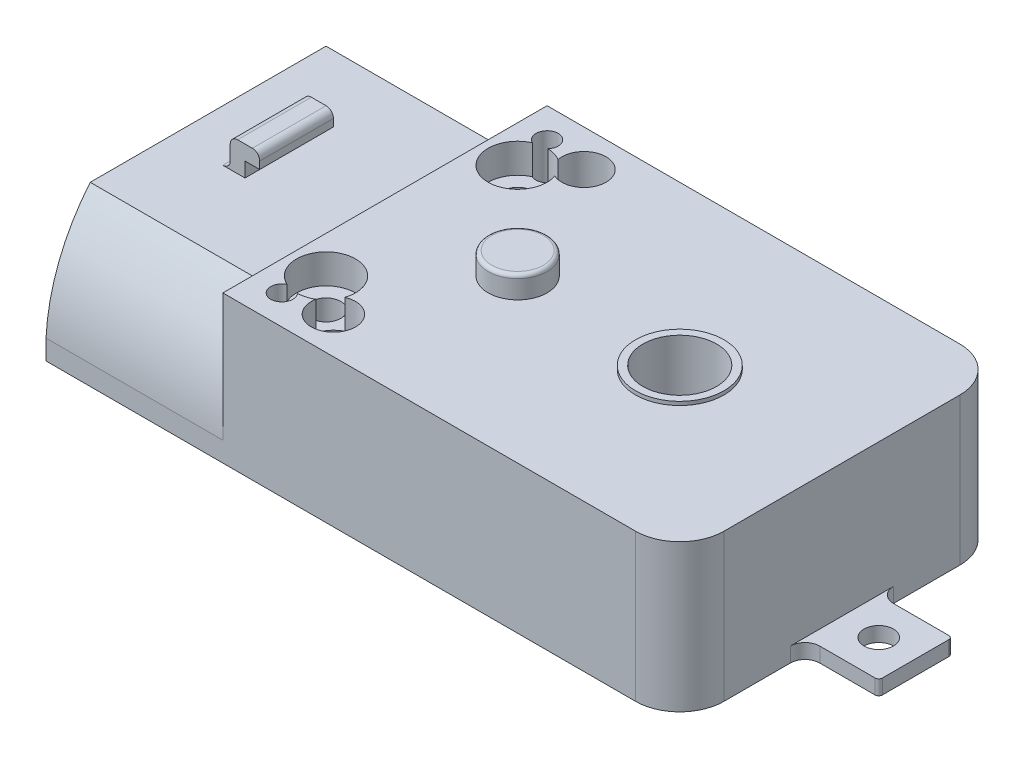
from build123d import *

# Parameters (mm, degrees)
BOSS_EXTRUDE2_DEPTH     = 9
SKETCH4_W               = 5
SKETCH4_H               = 1
BOSS_EXTRUDE3_DEPTH     = 5
SKETCH5_R               = 1
CUT_EXTRUDE1_DEPTH      = 5
FILLET1_R               = 1
FILLET2_R               = 1
FILLET3_R               = 3
FILLET4_R               = 3
BOSS_EXTRUDE4_DEPTH     = 12
FILLET6_R               = 0.25
CUT_EXTRUDE7_DEPTH      = 44.13930922
CUT_EXTRUDE7_DEPTH_BACK = 44.13930922
SKETCH10_R              = 1.5
SKETCH12_R              = 0.75
CUT_EXTRUDE8_DEPTH      = 3
SKETCH13_W              = 1
SKETCH13_H              = 5
BOSS_EXTRUDE5_DEPTH     = 2
SKETCH14_W              = 5
SKETCH14_H              = 1
BOSS_EXTRUDE6_DEPTH     = 1
FILLET7_R               = 0.5
FILLET8_R               = 0.5
FILLET9_R               = 0.5
CUT_EXTRUDE9_DEPTH      = 10
BOSS_EXTRUDE7_START     = 1
BOSS_EXTRUDE7_DEPTH     = 1
SKETCH18_R              = 1.5
CUT_EXTRUDE12_DEPTH     = 44.358966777
SKETCH19_R              = 0.75
CUT_EXTRUDE14_DEPTH     = 44.358966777
SKETCH20_R              = 2
BOSS_EXTRUDE8_DEPTH     = 1.5
FILLET10_R              = 0.25
SKETCH21_R              = 2.5
CUT_EXTRUDE15_DEPTH     = 5
BOSS_EXTRUDE9_START     = 0.25
SKETCH22_R              = 3
SKETCH22_R_2            = 2.5
BOSS_EXTRUDE9_DEPTH     = 0.25
SKETCH24_R              = 2
CUT_EXTRUDE16_DEPTH     = 2
SKETCH25_R              = 1
CUT_EXTRUDE17_DEPTH     = 5


with BuildPart() as part:
    # Sketch2 → Boss-Extrude2 (new body)
    with BuildSketch(Plane(origin=(0, 0, 0), x_dir=(1, 0, 0), z_dir=(0, 1, 0))):
        Polygon((0, 11), (31, 11), (31, 13.5), (31, 22), (0, 22), align=None)
        Polygon((31, 8.5), (31, 11), (0, 11), (0, 0), (31, 0), align=None)
    extrude(amount=BOSS_EXTRUDE2_DEPTH)

    # Sketch4 → Boss-Extrude3 (add)
    with BuildSketch(Plane(origin=(31, 0, 0), x_dir=(0, 0, -1), z_dir=(1, 0, 0))):
        with Locations((11, 0.5)):
            Rectangle(SKETCH4_W, SKETCH4_H)
    extrude(amount=BOSS_EXTRUDE3_DEPTH)

    # Sketch5 → Cut-Extrude1 (cut)
    with BuildSketch(Plane(origin=(0, 1, 0), x_dir=(1, 0, 0), z_dir=(0, 1, 0))):
        with Locations(Location((33.5, 11, 0), (0, 0, 270))):
            Circle(SKETCH5_R)
    extrude(amount=-CUT_EXTRUDE1_DEPTH, mode=Mode.SUBTRACT)

    # Fillet1
    fillet1_edges = [part.edges().sort_by_distance(p)[0] for p in [
        (31, 0.5, -8.5),
    ]]
    fillet(fillet1_edges, radius=FILLET1_R)

    # Fillet2
    fillet2_edges = [part.edges().sort_by_distance(p)[0] for p in [
        (31, 0.5, -13.5),
    ]]
    fillet(fillet2_edges, radius=FILLET2_R)

    # Fillet3
    fillet3_edges = [part.edges().sort_by_distance(p)[0] for p in [
        (31, 4.5, 0),
    ]]
    fillet(fillet3_edges, radius=FILLET3_R)

    # Fillet4
    fillet4_edges = [part.edges().sort_by_distance(p)[0] for p in [
        (31, 4.5, -22),
    ]]
    fillet(fillet4_edges, radius=FILLET4_R)

    # Sketch6 → Boss-Extrude4 (add)
    with BuildSketch(Plane.ZY):
        with BuildLine():
            Line((-22, 0), (-11, 0))
            Line((-11, 0), (-11, 9))
            Line((-11, 9), (-19, 9))
            ThreePointArc((-19, 9), (-21.121122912, 5.415884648), (-22, 1.344936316))
            Line((-22, 1.344936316), (-22, 0))
        make_face()
        with BuildLine():
            Line((-11, 9), (-11, 0))
            Line((-11, 0), (0, 0))
            Line((0, 0), (0, 1.344936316))
            ThreePointArc((0, 1.344936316), (-0.878877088, 5.415884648), (-3, 9))
            Line((-3, 9), (-11, 9))
        make_face()
    extrude(amount=BOSS_EXTRUDE4_DEPTH)

    # Fillet6
    fillet6_edges = [part.edges().sort_by_distance(p)[0] for p in [
        (36, 0.5, -13.5),
        (36, 0.5, -8.5),
    ]]
    fillet(fillet6_edges, radius=FILLET6_R)

    # Sketch10 → Cut-Extrude7 (cut, two sides: drawn at the far end of the back side and taken through both)
    with BuildSketch(Plane(origin=(0, 9, 0), x_dir=(1, 0, 0), z_dir=(0, 1, 0)).offset(-CUT_EXTRUDE7_DEPTH_BACK)):
        with Locations(Location((5, 19.5, 0), (0, 0, 270))):
            Circle(SKETCH10_R)
        with Locations(Location((5, 2.5, 0), (0, 0, 270))):
            Circle(SKETCH10_R)
    extrude(amount=CUT_EXTRUDE7_DEPTH + CUT_EXTRUDE7_DEPTH_BACK, mode=Mode.SUBTRACT)

    # Sketch12 → Cut-Extrude8 (cut)
    with BuildSketch(Plane(origin=(0, 9, 0), x_dir=(1, 0, 0), z_dir=(0, 1, 0))):
        with Locations(Location((2, 2, 0), (0, 0, 270))):
            Circle(SKETCH12_R)
        with Locations(Location((2, 20, 0), (0, 0, 270))):
            Circle(SKETCH12_R)
    extrude(amount=-CUT_EXTRUDE8_DEPTH, mode=Mode.SUBTRACT)

    # Sketch13 → Boss-Extrude5 (add)
    with BuildSketch(Plane(origin=(0, 9, 0), x_dir=(1, 0, 0), z_dir=(0, 1, 0))):
        with Locations((-7.5, 11)):
            Rectangle(SKETCH13_W, SKETCH13_H)
    extrude(amount=BOSS_EXTRUDE5_DEPTH)

    # Sketch14 → Boss-Extrude6 (add)
    with BuildSketch(Plane(origin=(-7, 0, 0), x_dir=(0, 0, -1), z_dir=(1, 0, 0))):
        with Locations((11, 10.5)):
            Rectangle(SKETCH14_W, SKETCH14_H)
    extrude(amount=BOSS_EXTRUDE6_DEPTH)

    # Fillet7
    fillet7_edges = [part.edges().sort_by_distance(p)[0] for p in [
        (-8, 11, -11),
    ]]
    fillet(fillet7_edges, radius=FILLET7_R)

    # Fillet8
    fillet8_edges = [part.edges().sort_by_distance(p)[0] for p in [
        (-8, 9, -11),
    ]]
    fillet(fillet8_edges, radius=FILLET8_R)

    # Fillet9
    fillet9_edges = [part.edges().sort_by_distance(p)[0] for p in [
        (-6, 11, -11),
    ]]
    fillet(fillet9_edges, radius=FILLET9_R)

    # Sketch16 → Cut-Extrude9 (cut)
    with BuildSketch(Plane.ZY.offset(12)):
        with BuildLine():
            Line((-18.232108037, 8.359420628), (-3.767891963, 8.359420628))
            ThreePointArc((-3.767891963, 8.359420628), (-1.809932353, 5.051006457), (-0.998661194, 1.293207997))
            Line((-0.998661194, 1.293207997), (-0.998661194, 0))
            Line((-0.998661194, 0), (-21, 0))
            Line((-21, 0), (-21.001338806, 1.293207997))
            ThreePointArc((-21.001338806, 1.293207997), (-20.190067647, 5.051006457), (-18.232108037, 8.359420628))
        make_face()
    extrude(amount=-CUT_EXTRUDE9_DEPTH, mode=Mode.SUBTRACT)

    # Sketch17 → Boss-Extrude7 (add)
    with BuildSketch(Plane(origin=(0, 9, 0), x_dir=(1, 0, 0), z_dir=(0, 1, 0)).offset(BOSS_EXTRUDE7_START)):
        with BuildLine():
            Line((0, 3), (0, 19))
            Line((0, 19), (0, 22))
            Line((0, 22), (28, 22))
            ThreePointArc((28, 22), (30.121320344, 21.121320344), (31, 19))
            Line((31, 19), (31, 3))
            ThreePointArc((31, 3), (30.121320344, 0.878679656), (28, 0))
            Line((28, 0), (0, 0))
            Line((0, 0), (0, 3))
        make_face()
    extrude(amount=-BOSS_EXTRUDE7_DEPTH)

    # Sketch18 → Cut-Extrude12 (cut, through all)
    with BuildSketch(Plane(origin=(0, 10, 0), x_dir=(1, 0, 0), z_dir=(0, 1, 0))):
        with Locations(Location((5, 19.5, 0), (0, 0, 270))):
            Circle(SKETCH18_R)
        with Locations(Location((5, 2.5, 0), (0, 0, 270))):
            Circle(SKETCH18_R)
    extrude(amount=-CUT_EXTRUDE12_DEPTH, mode=Mode.SUBTRACT)

    # Sketch19 → Cut-Extrude14 (cut, through all)
    with BuildSketch(Plane(origin=(0, 10, 0), x_dir=(1, 0, 0), z_dir=(0, 1, 0))):
        with Locations(Location((2, 20, 0), (0, 0, 270))):
            Circle(SKETCH19_R)
        with Locations(Location((2, 2, 0), (0, 0, 270))):
            Circle(SKETCH19_R)
    extrude(amount=-CUT_EXTRUDE14_DEPTH, mode=Mode.SUBTRACT)

    # Sketch20 → Boss-Extrude8 (add)
    with BuildSketch(Plane(origin=(0, 10, 0), x_dir=(1, 0, 0), z_dir=(0, 1, 0))):
        with Locations(Location((9, 11, 0), (0, 0, 270))):
            Circle(SKETCH20_R)
    extrude(amount=BOSS_EXTRUDE8_DEPTH)

    # Fillet10
    fillet10_edges = [part.edges().sort_by_distance(p)[0] for p in [
        (9, 11.5, -13),
    ]]
    fillet(fillet10_edges, radius=FILLET10_R)

    # Sketch21 → Cut-Extrude15 (cut)
    with BuildSketch(Plane(origin=(0, 10, 0), x_dir=(1, 0, 0), z_dir=(0, 1, 0))):
        with Locations(Location((20, 11, 0), (0, 0, 270))):
            Circle(SKETCH21_R)
    extrude(amount=-CUT_EXTRUDE15_DEPTH, mode=Mode.SUBTRACT)

    # Sketch22 → Boss-Extrude9 (add)
    with BuildSketch(Plane(origin=(0, 10, 0), x_dir=(1, 0, 0), z_dir=(0, 1, 0)).offset(BOSS_EXTRUDE9_START)):
        with Locations(Location((20, 11, 0), (0, 0, 270))):
            Circle(SKETCH22_R)
        with Locations(Location((20, 11, 0), (0, 0, 270))):
            Circle(SKETCH22_R_2, mode=Mode.SUBTRACT)
    extrude(amount=-BOSS_EXTRUDE9_DEPTH)

    # Sketch24 → Cut-Extrude16 (cut)
    with BuildSketch(Plane(origin=(0, 10, 0), x_dir=(1, 0, 0), z_dir=(0, 1, 0))):
        with Locations((2.5, 17.5)):
            Circle(SKETCH24_R)
        with Locations((2.5, 4.5)):
            Circle(SKETCH24_R)
    extrude(amount=-CUT_EXTRUDE16_DEPTH, mode=Mode.SUBTRACT)

    # Sketch25 → Cut-Extrude17 (cut)
    with BuildSketch(Plane(origin=(0, 10, 0), x_dir=(1, 0, 0), z_dir=(0, 1, 0))):
        with Locations(Location((2.5, 17.5, 0), (0, 0, 270))):
            Circle(SKETCH25_R)
        with Locations(Location((2.5, 4.5, 0), (0, 0, 270))):
            Circle(SKETCH25_R)
    extrude(amount=-CUT_EXTRUDE17_DEPTH, mode=Mode.SUBTRACT)


solid = part.part
